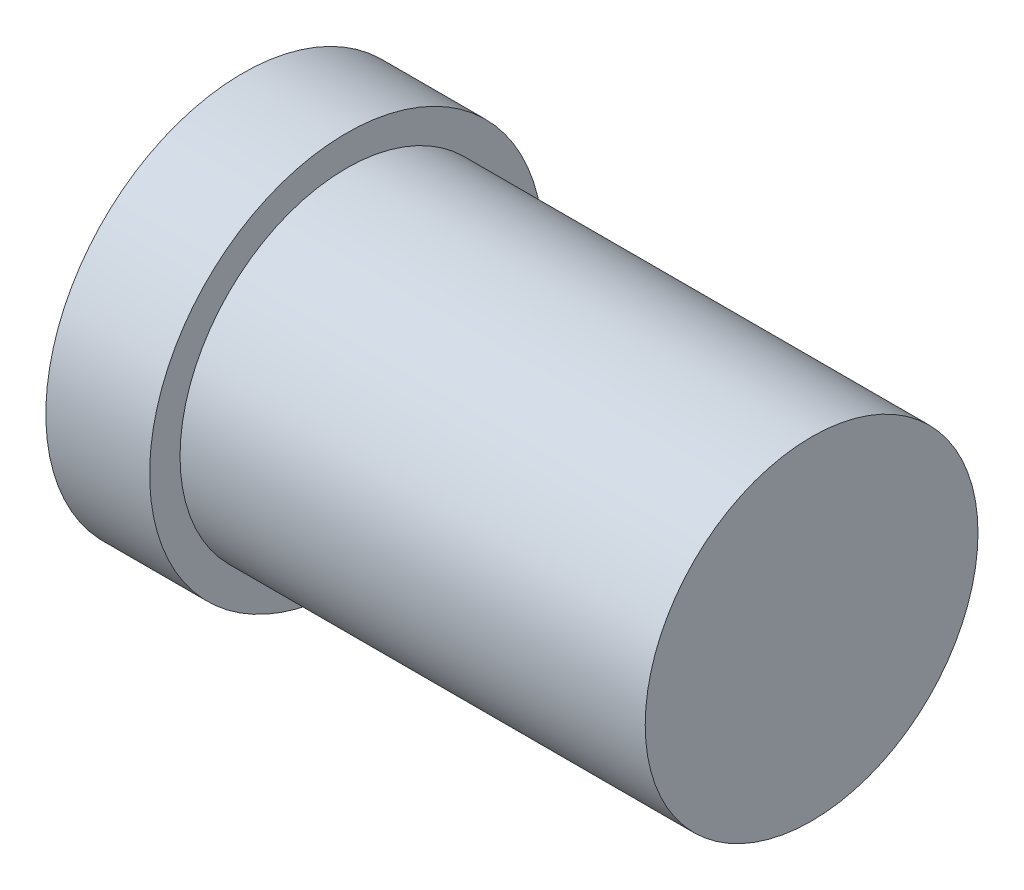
ISO-10303-21;
HEADER;
FILE_DESCRIPTION(('STEP AP214'),'2;1');
FILE_NAME('part.step','',(''),(''),'','','');
FILE_SCHEMA(('AUTOMOTIVE_DESIGN { 1 0 10303 214 1 1 1 1 }'));
ENDSEC;
DATA;
#1=APPLICATION_CONTEXT('core data for automotive mechanical design processes');
#2=APPLICATION_PROTOCOL_DEFINITION('international standard','automotive_design',2000,#1);
#3=PRODUCT_CONTEXT('',#1,'mechanical');
#4=PRODUCT('Part','Part','',(#3));
#5=PRODUCT_RELATED_PRODUCT_CATEGORY('part','',(#4));
#6=PRODUCT_DEFINITION_FORMATION('','',#4);
#7=PRODUCT_DEFINITION_CONTEXT('part definition',#1,'design');
#8=PRODUCT_DEFINITION('design','',#6,#7);
#9=PRODUCT_DEFINITION_SHAPE('','',#8);
#10=(LENGTH_UNIT() NAMED_UNIT(*) SI_UNIT(.MILLI.,.METRE.));
#11=(NAMED_UNIT(*) PLANE_ANGLE_UNIT() SI_UNIT($,.RADIAN.));
#12=(NAMED_UNIT(*) SI_UNIT($,.STERADIAN.) SOLID_ANGLE_UNIT());
#13=UNCERTAINTY_MEASURE_WITH_UNIT(LENGTH_MEASURE(1.E-05),#10,'distance_accuracy_value','');
#14=(GEOMETRIC_REPRESENTATION_CONTEXT(3) GLOBAL_UNCERTAINTY_ASSIGNED_CONTEXT((#13)) GLOBAL_UNIT_ASSIGNED_CONTEXT((#10,
#11,#12)) REPRESENTATION_CONTEXT('',''));
#15=CARTESIAN_POINT('',(0.,0.,0.));
#16=DIRECTION('',(0.,0.,1.));
#17=DIRECTION('',(1.,0.,0.));
#18=AXIS2_PLACEMENT_3D('',#15,#16,#17);
#19=CARTESIAN_POINT('',(0.,0.,0.));
#20=DIRECTION('',(1.,0.,0.));
#21=DIRECTION('',(0.,0.,-1.));
#22=AXIS2_PLACEMENT_3D('',#19,#20,#21);
#23=PLANE('',#22);
#24=CARTESIAN_POINT('',(0.,0.,0.));
#25=DIRECTION('',(1.,0.,0.));
#26=DIRECTION('',(0.,0.,-1.));
#27=AXIS2_PLACEMENT_3D('',#24,#25,#26);
#28=CIRCLE('',#27,6.985);
#29=CARTESIAN_POINT('',(0.,0.,-6.985));
#30=VERTEX_POINT('',#29);
#31=EDGE_CURVE('E36',#30,#30,#28,.T.);
#32=ORIENTED_EDGE('',*,*,#31,.T.);
#33=EDGE_LOOP('',(#32));
#34=FACE_BOUND('',#33,.T.);
#35=CARTESIAN_POINT('',(0.,0.,0.));
#36=DIRECTION('',(1.,0.,0.));
#37=DIRECTION('',(0.,0.,-1.));
#38=AXIS2_PLACEMENT_3D('',#35,#36,#37);
#39=CIRCLE('',#38,5.9055);
#40=CARTESIAN_POINT('',(0.,0.,-5.9055));
#41=VERTEX_POINT('',#40);
#42=EDGE_CURVE('E44',#41,#41,#39,.T.);
#43=ORIENTED_EDGE('',*,*,#42,.F.);
#44=EDGE_LOOP('',(#43));
#45=FACE_BOUND('',#44,.T.);
#46=ADVANCED_FACE('F29',(#34,#45),#23,.T.);
#47=CARTESIAN_POINT('',(-3.683,0.,0.));
#48=DIRECTION('',(1.,0.,0.));
#49=DIRECTION('',(0.,0.,-1.));
#50=AXIS2_PLACEMENT_3D('',#47,#48,#49);
#51=CYLINDRICAL_SURFACE('',#50,6.985);
#52=CARTESIAN_POINT('',(-3.683,0.,0.));
#53=DIRECTION('',(1.,0.,0.));
#54=DIRECTION('',(0.,0.,-1.));
#55=AXIS2_PLACEMENT_3D('',#52,#53,#54);
#56=CIRCLE('',#55,6.985);
#57=CARTESIAN_POINT('',(-3.683,0.,-6.985));
#58=VERTEX_POINT('',#57);
#59=EDGE_CURVE('E10',#58,#58,#56,.T.);
#60=ORIENTED_EDGE('',*,*,#59,.T.);
#61=EDGE_LOOP('',(#60));
#62=FACE_BOUND('',#61,.T.);
#63=ORIENTED_EDGE('',*,*,#31,.F.);
#64=EDGE_LOOP('',(#63));
#65=FACE_BOUND('',#64,.T.);
#66=ADVANCED_FACE('F31',(#62,#65),#51,.T.);
#67=CARTESIAN_POINT('',(-3.683,0.,0.));
#68=DIRECTION('',(1.,0.,0.));
#69=DIRECTION('',(0.,0.,-1.));
#70=AXIS2_PLACEMENT_3D('',#67,#68,#69);
#71=PLANE('',#70);
#72=CARTESIAN_POINT('',(-3.683,0.,0.));
#73=DIRECTION('',(-1.,0.,0.));
#74=DIRECTION('',(0.,0.,1.));
#75=AXIS2_PLACEMENT_3D('',#72,#73,#74);
#76=CIRCLE('',#75,5.9055);
#77=CARTESIAN_POINT('',(-3.683,0.,5.9055));
#78=VERTEX_POINT('',#77);
#79=EDGE_CURVE('E52',#78,#78,#76,.T.);
#80=ORIENTED_EDGE('',*,*,#79,.F.);
#81=EDGE_LOOP('',(#80));
#82=FACE_BOUND('',#81,.T.);
#83=ORIENTED_EDGE('',*,*,#59,.F.);
#84=EDGE_LOOP('',(#83));
#85=FACE_BOUND('',#84,.T.);
#86=ADVANCED_FACE('F58',(#82,#85),#71,.F.);
#87=CARTESIAN_POINT('',(16.51,0.,0.));
#88=DIRECTION('',(-1.,0.,0.));
#89=DIRECTION('',(0.,0.,1.));
#90=AXIS2_PLACEMENT_3D('',#87,#88,#89);
#91=CYLINDRICAL_SURFACE('',#90,5.9055);
#92=CARTESIAN_POINT('',(16.51,0.,0.));
#93=DIRECTION('',(1.,0.,0.));
#94=DIRECTION('',(0.,0.,-1.));
#95=AXIS2_PLACEMENT_3D('',#92,#93,#94);
#96=CIRCLE('',#95,5.9055);
#97=CARTESIAN_POINT('',(16.51,0.,-5.9055));
#98=VERTEX_POINT('',#97);
#99=EDGE_CURVE('E40',#98,#98,#96,.T.);
#100=ORIENTED_EDGE('',*,*,#99,.F.);
#101=EDGE_LOOP('',(#100));
#102=FACE_BOUND('',#101,.T.);
#103=ORIENTED_EDGE('',*,*,#42,.T.);
#104=EDGE_LOOP('',(#103));
#105=FACE_BOUND('',#104,.T.);
#106=ADVANCED_FACE('F61',(#102,#105),#91,.T.);
#107=CARTESIAN_POINT('',(16.51,0.,0.));
#108=DIRECTION('',(1.,0.,0.));
#109=DIRECTION('',(0.,0.,-1.));
#110=AXIS2_PLACEMENT_3D('',#107,#108,#109);
#111=PLANE('',#110);
#112=ORIENTED_EDGE('',*,*,#99,.T.);
#113=EDGE_LOOP('',(#112));
#114=FACE_BOUND('',#113,.T.);
#115=ADVANCED_FACE('F66',(#114),#111,.T.);
#116=CARTESIAN_POINT('',(-3.683,0.,0.));
#117=DIRECTION('',(-1.,0.,0.));
#118=DIRECTION('',(0.,0.,1.));
#119=AXIS2_PLACEMENT_3D('',#116,#117,#118);
#120=CONICAL_SURFACE('',#119,5.9055,0.935496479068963);
#121=CARTESIAN_POINT('',(-2.4384,0.,0.));
#122=DIRECTION('',(-1.,0.,0.));
#123=DIRECTION('',(0.,0.,1.));
#124=AXIS2_PLACEMENT_3D('',#121,#122,#123);
#125=CIRCLE('',#124,4.21736562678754);
#126=CARTESIAN_POINT('',(-2.4384,0.,4.21736562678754));
#127=VERTEX_POINT('',#126);
#128=EDGE_CURVE('E49',#127,#127,#125,.T.);
#129=ORIENTED_EDGE('',*,*,#128,.F.);
#130=EDGE_LOOP('',(#129));
#131=FACE_BOUND('',#130,.T.);
#132=ORIENTED_EDGE('',*,*,#79,.T.);
#133=EDGE_LOOP('',(#132));
#134=FACE_BOUND('',#133,.T.);
#135=ADVANCED_FACE('F56',(#131,#134),#120,.F.);
#136=CARTESIAN_POINT('',(4.08463698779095,0.,0.));
#137=DIRECTION('',(1.,0.,0.));
#138=DIRECTION('',(0.,1.,0.));
#139=AXIS2_PLACEMENT_3D('',#136,#137,#138);
#140=SPHERICAL_SURFACE('',#139,7.76763698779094);
#141=ORIENTED_EDGE('',*,*,#128,.T.);
#142=EDGE_LOOP('',(#141));
#143=FACE_BOUND('',#142,.T.);
#144=ADVANCED_FACE('F80',(#143),#140,.T.);
#145=CLOSED_SHELL('',(#46,#66,#86,#106,#115,#135,#144));
#146=MANIFOLD_SOLID_BREP('B2',#145);
#147=ADVANCED_BREP_SHAPE_REPRESENTATION('',(#18,#146),#14);
#148=SHAPE_DEFINITION_REPRESENTATION(#9,#147);
ENDSEC;
END-ISO-10303-21;
